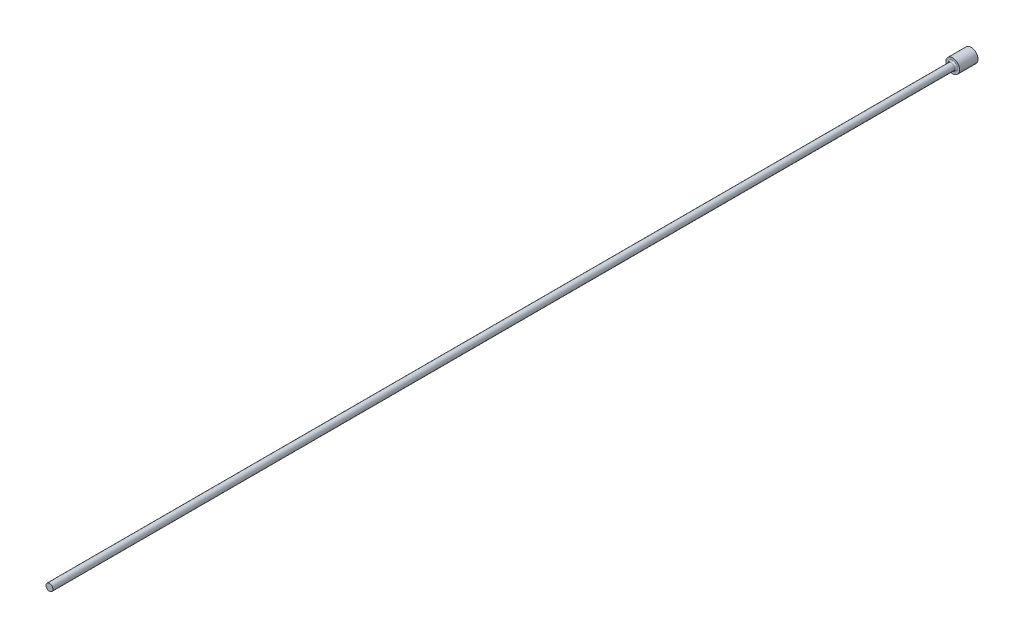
from build123d import *

# Parameters (mm, degrees)
FILLET1_R = 0.3


with BuildPart() as part:
    # FV → Revolve1 (revolve)
    with BuildSketch(Plane(origin=(0, 0, 0), x_dir=(1, 0, 0), z_dir=(0, 1, 0)), mode=Mode.PRIVATE) as revolve1_sk:
        Polygon((0, 0), (1.5, 0), (1.5, -4), (0.75, -4), (0.75, -200), (0, -200), align=None)
    revolve(revolve1_sk.sketch.rotate(Axis((0, 0, -9.033228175), (0, 0, 1)), 180), axis=Axis((0, 0, -9.033228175), (0, 0, 1)))

    # Fillet1
    fillet1_edges = [part.edges().sort_by_distance(p)[0] for p in [
        (0.75, 0, 4),
    ]]
    fillet(fillet1_edges, radius=FILLET1_R)


solid = part.part
